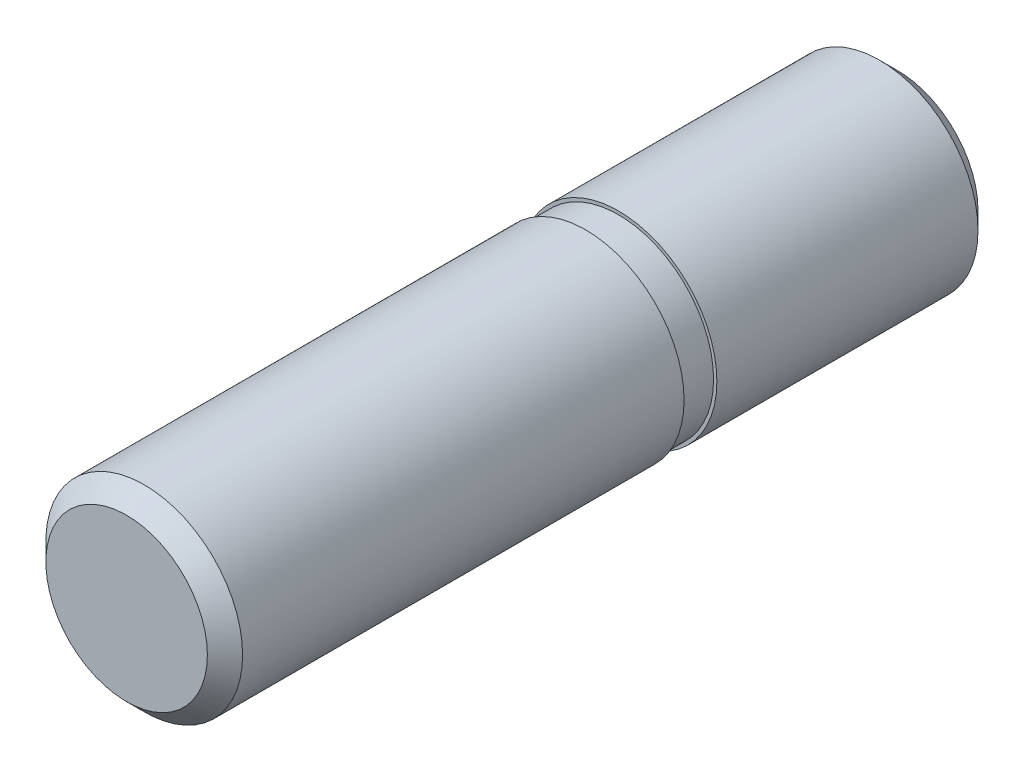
ISO-10303-21;
HEADER;
FILE_DESCRIPTION(('STEP AP214'),'2;1');
FILE_NAME('part.step','',(''),(''),'','','');
FILE_SCHEMA(('AUTOMOTIVE_DESIGN { 1 0 10303 214 1 1 1 1 }'));
ENDSEC;
DATA;
#1=APPLICATION_CONTEXT('core data for automotive mechanical design processes');
#2=APPLICATION_PROTOCOL_DEFINITION('international standard','automotive_design',2000,#1);
#3=PRODUCT_CONTEXT('',#1,'mechanical');
#4=PRODUCT('Part','Part','',(#3));
#5=PRODUCT_RELATED_PRODUCT_CATEGORY('part','',(#4));
#6=PRODUCT_DEFINITION_FORMATION('','',#4);
#7=PRODUCT_DEFINITION_CONTEXT('part definition',#1,'design');
#8=PRODUCT_DEFINITION('design','',#6,#7);
#9=PRODUCT_DEFINITION_SHAPE('','',#8);
#10=(LENGTH_UNIT() NAMED_UNIT(*) SI_UNIT(.MILLI.,.METRE.));
#11=(NAMED_UNIT(*) PLANE_ANGLE_UNIT() SI_UNIT($,.RADIAN.));
#12=(NAMED_UNIT(*) SI_UNIT($,.STERADIAN.) SOLID_ANGLE_UNIT());
#13=UNCERTAINTY_MEASURE_WITH_UNIT(LENGTH_MEASURE(1.E-05),#10,'distance_accuracy_value','');
#14=(GEOMETRIC_REPRESENTATION_CONTEXT(3) GLOBAL_UNCERTAINTY_ASSIGNED_CONTEXT((#13)) GLOBAL_UNIT_ASSIGNED_CONTEXT((#10,
#11,#12)) REPRESENTATION_CONTEXT('',''));
#15=CARTESIAN_POINT('',(0.,0.,0.));
#16=DIRECTION('',(0.,0.,1.));
#17=DIRECTION('',(1.,0.,0.));
#18=AXIS2_PLACEMENT_3D('',#15,#16,#17);
#19=CARTESIAN_POINT('',(0.,0.,7.5));
#20=DIRECTION('',(0.,0.,1.));
#21=DIRECTION('',(1.,0.,0.));
#22=AXIS2_PLACEMENT_3D('',#19,#20,#21);
#23=CYLINDRICAL_SURFACE('',#22,6.);
#24=CARTESIAN_POINT('',(0.,0.,28.9265));
#25=DIRECTION('',(0.,0.,1.));
#26=DIRECTION('',(1.,0.,0.));
#27=AXIS2_PLACEMENT_3D('',#24,#25,#26);
#28=CIRCLE('',#27,6.);
#29=CARTESIAN_POINT('',(6.,0.,28.9265));
#30=VERTEX_POINT('',#29);
#31=EDGE_CURVE('E18',#30,#30,#28,.F.);
#32=ORIENTED_EDGE('',*,*,#31,.T.);
#33=EDGE_LOOP('',(#32));
#34=FACE_BOUND('',#33,.T.);
#35=CARTESIAN_POINT('',(0.,0.,2.));
#36=DIRECTION('',(0.,0.,1.));
#37=DIRECTION('',(1.,0.,0.));
#38=AXIS2_PLACEMENT_3D('',#35,#36,#37);
#39=CIRCLE('',#38,6.);
#40=CARTESIAN_POINT('',(6.,0.,2.));
#41=VERTEX_POINT('',#40);
#42=EDGE_CURVE('E26',#41,#41,#39,.T.);
#43=ORIENTED_EDGE('',*,*,#42,.T.);
#44=EDGE_LOOP('',(#43));
#45=FACE_BOUND('',#44,.T.);
#46=ADVANCED_FACE('F12',(#34,#45),#23,.T.);
#47=CARTESIAN_POINT('',(0.,0.,2.));
#48=DIRECTION('',(0.,0.,1.));
#49=DIRECTION('',(1.,0.,0.));
#50=AXIS2_PLACEMENT_3D('',#47,#48,#49);
#51=PLANE('',#50);
#52=CARTESIAN_POINT('',(0.,0.,2.));
#53=DIRECTION('',(0.,0.,-1.));
#54=DIRECTION('',(-1.,0.,0.));
#55=AXIS2_PLACEMENT_3D('',#52,#53,#54);
#56=CIRCLE('',#55,5.8);
#57=CARTESIAN_POINT('',(-5.8,0.,2.));
#58=VERTEX_POINT('',#57);
#59=EDGE_CURVE('E33',#58,#58,#56,.T.);
#60=ORIENTED_EDGE('',*,*,#59,.F.);
#61=EDGE_LOOP('',(#60));
#62=FACE_BOUND('',#61,.T.);
#63=ORIENTED_EDGE('',*,*,#42,.F.);
#64=EDGE_LOOP('',(#63));
#65=FACE_BOUND('',#64,.T.);
#66=ADVANCED_FACE('F46',(#62,#65),#51,.F.);
#67=CARTESIAN_POINT('',(0.,0.,30.));
#68=DIRECTION('',(0.,0.,1.));
#69=DIRECTION('',(1.,0.,0.));
#70=AXIS2_PLACEMENT_3D('',#67,#68,#69);
#71=PLANE('',#70);
#72=CARTESIAN_POINT('',(0.,0.,30.));
#73=DIRECTION('',(0.,0.,1.));
#74=DIRECTION('',(1.,0.,0.));
#75=AXIS2_PLACEMENT_3D('',#72,#73,#74);
#76=CIRCLE('',#75,4.9265);
#77=CARTESIAN_POINT('',(4.9265,0.,30.));
#78=VERTEX_POINT('',#77);
#79=EDGE_CURVE('E22',#78,#78,#76,.T.);
#80=ORIENTED_EDGE('',*,*,#79,.T.);
#81=EDGE_LOOP('',(#80));
#82=FACE_BOUND('',#81,.T.);
#83=ADVANCED_FACE('F49',(#82),#71,.T.);
#84=CARTESIAN_POINT('',(0.,0.,30.));
#85=DIRECTION('',(0.,0.,-1.));
#86=DIRECTION('',(-1.,0.,0.));
#87=AXIS2_PLACEMENT_3D('',#84,#85,#86);
#88=CONICAL_SURFACE('',#87,4.9265,0.785398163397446);
#89=ORIENTED_EDGE('',*,*,#31,.F.);
#90=EDGE_LOOP('',(#89));
#91=FACE_BOUND('',#90,.T.);
#92=ORIENTED_EDGE('',*,*,#79,.F.);
#93=EDGE_LOOP('',(#92));
#94=FACE_BOUND('',#93,.T.);
#95=ADVANCED_FACE('F72',(#91,#94),#88,.T.);
#96=CARTESIAN_POINT('',(0.,0.,-3.54876251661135));
#97=DIRECTION('',(0.,0.,-1.));
#98=DIRECTION('',(-1.,0.,0.));
#99=AXIS2_PLACEMENT_3D('',#96,#97,#98);
#100=CYLINDRICAL_SURFACE('',#99,5.8);
#101=ORIENTED_EDGE('',*,*,#59,.T.);
#102=EDGE_LOOP('',(#101));
#103=FACE_BOUND('',#102,.T.);
#104=CARTESIAN_POINT('',(0.,0.,0.));
#105=DIRECTION('',(0.,0.,1.));
#106=DIRECTION('',(1.,0.,0.));
#107=AXIS2_PLACEMENT_3D('',#104,#105,#106);
#108=CIRCLE('',#107,5.8);
#109=CARTESIAN_POINT('',(5.8,0.,0.));
#110=VERTEX_POINT('',#109);
#111=EDGE_CURVE('E8',#110,#110,#108,.T.);
#112=ORIENTED_EDGE('',*,*,#111,.T.);
#113=EDGE_LOOP('',(#112));
#114=FACE_BOUND('',#113,.T.);
#115=ADVANCED_FACE('F44',(#103,#114),#100,.T.);
#116=CARTESIAN_POINT('',(0.,2.46325,-17.));
#117=DIRECTION('',(0.,0.,-1.));
#118=DIRECTION('',(-1.,0.,0.));
#119=AXIS2_PLACEMENT_3D('',#116,#117,#118);
#120=PLANE('',#119);
#121=CARTESIAN_POINT('',(0.,0.,-17.0000000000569));
#122=DIRECTION('',(0.,0.,1.));
#123=DIRECTION('',(1.,0.,0.));
#124=AXIS2_PLACEMENT_3D('',#121,#122,#123);
#125=CIRCLE('',#124,4.92649999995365);
#126=CARTESIAN_POINT('',(4.92649999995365,0.,-17.0000000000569));
#127=VERTEX_POINT('',#126);
#128=EDGE_CURVE('E29',#127,#127,#125,.T.);
#129=ORIENTED_EDGE('',*,*,#128,.F.);
#130=EDGE_LOOP('',(#129));
#131=FACE_BOUND('',#130,.T.);
#132=ADVANCED_FACE('F89',(#131),#120,.T.);
#133=CARTESIAN_POINT('',(0.,0.,-15.9264999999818));
#134=DIRECTION('',(0.,0.,1.));
#135=DIRECTION('',(1.,0.,0.));
#136=AXIS2_PLACEMENT_3D('',#133,#134,#135);
#137=CONICAL_SURFACE('',#136,6.00000000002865,0.785398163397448);
#138=CARTESIAN_POINT('',(0.,0.,-15.9265));
#139=DIRECTION('',(0.,0.,1.));
#140=DIRECTION('',(1.,0.,0.));
#141=AXIS2_PLACEMENT_3D('',#138,#139,#140);
#142=CIRCLE('',#141,6.);
#143=CARTESIAN_POINT('',(6.,0.,-15.9265));
#144=VERTEX_POINT('',#143);
#145=EDGE_CURVE('E32',#144,#144,#142,.T.);
#146=ORIENTED_EDGE('',*,*,#145,.F.);
#147=EDGE_LOOP('',(#146));
#148=FACE_BOUND('',#147,.T.);
#149=ORIENTED_EDGE('',*,*,#128,.T.);
#150=EDGE_LOOP('',(#149));
#151=FACE_BOUND('',#150,.T.);
#152=ADVANCED_FACE('F97',(#148,#151),#137,.T.);
#153=CARTESIAN_POINT('',(0.,0.,7.5));
#154=DIRECTION('',(0.,0.,1.));
#155=DIRECTION('',(1.,0.,0.));
#156=AXIS2_PLACEMENT_3D('',#153,#154,#155);
#157=CYLINDRICAL_SURFACE('',#156,6.);
#158=CARTESIAN_POINT('',(0.,0.,0.));
#159=DIRECTION('',(0.,0.,1.));
#160=DIRECTION('',(1.,0.,0.));
#161=AXIS2_PLACEMENT_3D('',#158,#159,#160);
#162=CIRCLE('',#161,6.);
#163=CARTESIAN_POINT('',(6.,0.,0.));
#164=VERTEX_POINT('',#163);
#165=EDGE_CURVE('E34',#164,#164,#162,.T.);
#166=ORIENTED_EDGE('',*,*,#165,.F.);
#167=EDGE_LOOP('',(#166));
#168=FACE_BOUND('',#167,.T.);
#169=ORIENTED_EDGE('',*,*,#145,.T.);
#170=EDGE_LOOP('',(#169));
#171=FACE_BOUND('',#170,.T.);
#172=ADVANCED_FACE('F106',(#168,#171),#157,.T.);
#173=CARTESIAN_POINT('',(0.,0.,0.));
#174=DIRECTION('',(0.,0.,1.));
#175=DIRECTION('',(1.,0.,0.));
#176=AXIS2_PLACEMENT_3D('',#173,#174,#175);
#177=PLANE('',#176);
#178=ORIENTED_EDGE('',*,*,#111,.F.);
#179=EDGE_LOOP('',(#178));
#180=FACE_BOUND('',#179,.T.);
#181=ORIENTED_EDGE('',*,*,#165,.T.);
#182=EDGE_LOOP('',(#181));
#183=FACE_BOUND('',#182,.T.);
#184=ADVANCED_FACE('F115',(#180,#183),#177,.T.);
#185=CLOSED_SHELL('',(#46,#66,#83,#95,#115,#132,#152,#172,#184));
#186=MANIFOLD_SOLID_BREP('B1',#185);
#187=ADVANCED_BREP_SHAPE_REPRESENTATION('',(#18,#186),#14);
#188=SHAPE_DEFINITION_REPRESENTATION(#9,#187);
ENDSEC;
END-ISO-10303-21;
